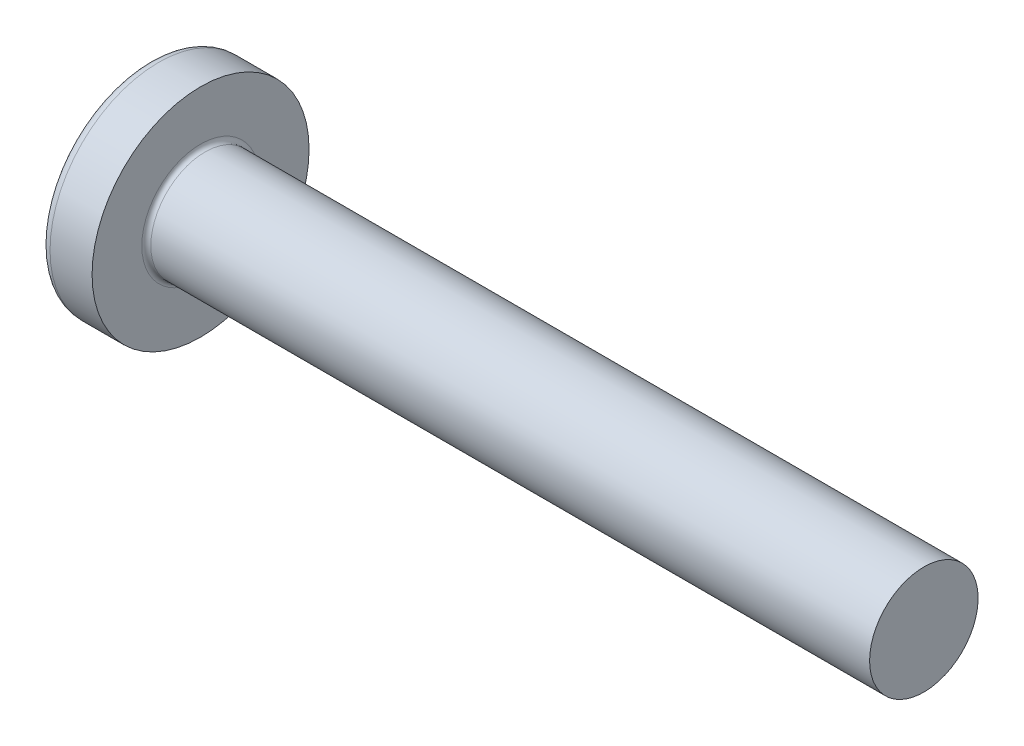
ISO-10303-21;
HEADER;
FILE_DESCRIPTION(('STEP AP214'),'2;1');
FILE_NAME('part.step','',(''),(''),'','','');
FILE_SCHEMA(('AUTOMOTIVE_DESIGN { 1 0 10303 214 1 1 1 1 }'));
ENDSEC;
DATA;
#1=APPLICATION_CONTEXT('core data for automotive mechanical design processes');
#2=APPLICATION_PROTOCOL_DEFINITION('international standard','automotive_design',2000,#1);
#3=PRODUCT_CONTEXT('',#1,'mechanical');
#4=PRODUCT('Part','Part','',(#3));
#5=PRODUCT_RELATED_PRODUCT_CATEGORY('part','',(#4));
#6=PRODUCT_DEFINITION_FORMATION('','',#4);
#7=PRODUCT_DEFINITION_CONTEXT('part definition',#1,'design');
#8=PRODUCT_DEFINITION('design','',#6,#7);
#9=PRODUCT_DEFINITION_SHAPE('','',#8);
#10=(LENGTH_UNIT() NAMED_UNIT(*) SI_UNIT(.MILLI.,.METRE.));
#11=(NAMED_UNIT(*) PLANE_ANGLE_UNIT() SI_UNIT($,.RADIAN.));
#12=(NAMED_UNIT(*) SI_UNIT($,.STERADIAN.) SOLID_ANGLE_UNIT());
#13=UNCERTAINTY_MEASURE_WITH_UNIT(LENGTH_MEASURE(1.E-05),#10,'distance_accuracy_value','');
#14=(GEOMETRIC_REPRESENTATION_CONTEXT(3) GLOBAL_UNCERTAINTY_ASSIGNED_CONTEXT((#13)) GLOBAL_UNIT_ASSIGNED_CONTEXT((#10,
#11,#12)) REPRESENTATION_CONTEXT('',''));
#15=CARTESIAN_POINT('',(0.,0.,0.));
#16=DIRECTION('',(0.,0.,1.));
#17=DIRECTION('',(1.,0.,0.));
#18=AXIS2_PLACEMENT_3D('',#15,#16,#17);
#19=CARTESIAN_POINT('',(10.,0.,0.));
#20=DIRECTION('',(-1.,0.,0.));
#21=DIRECTION('',(0.,1.,0.));
#22=AXIS2_PLACEMENT_3D('',#19,#20,#21);
#23=SPHERICAL_SURFACE('',#22,10.);
#24=CARTESIAN_POINT('',(1.83373872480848,0.,0.));
#25=DIRECTION('',(-1.,0.,0.));
#26=DIRECTION('',(0.,0.,1.));
#27=AXIS2_PLACEMENT_3D('',#24,#25,#26);
#28=CIRCLE('',#27,5.77167019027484);
#29=CARTESIAN_POINT('',(1.83373872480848,0.,5.77167019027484));
#30=VERTEX_POINT('',#29);
#31=EDGE_CURVE('E216',#30,#30,#28,.T.);
#32=ORIENTED_EDGE('',*,*,#31,.T.);
#33=EDGE_LOOP('',(#32));
#34=FACE_BOUND('',#33,.T.);
#35=CARTESIAN_POINT('',(0.11533271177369,0.,0.));
#36=DIRECTION('',(1.,0.,0.));
#37=DIRECTION('',(0.,0.,-1.));
#38=AXIS2_PLACEMENT_3D('',#35,#36,#37);
#39=CIRCLE('',#38,1.51438192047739);
#40=CARTESIAN_POINT('',(0.115332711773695,-0.709999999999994,-1.33762947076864));
#41=VERTEX_POINT('',#40);
#42=CARTESIAN_POINT('',(0.11533271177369,-1.33762947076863,-0.71));
#43=VERTEX_POINT('',#42);
#44=EDGE_CURVE('E343',#41,#43,#39,.F.);
#45=ORIENTED_EDGE('',*,*,#44,.F.);
#46=CARTESIAN_POINT('',(10.,-0.71,0.));
#47=DIRECTION('',(0.,1.,0.));
#48=DIRECTION('',(0.,0.,1.));
#49=AXIS2_PLACEMENT_3D('',#46,#47,#48);
#50=CIRCLE('',#49,9.97476315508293);
#51=CARTESIAN_POINT('',(0.516695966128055,-0.709999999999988,-3.09238493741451));
#52=VERTEX_POINT('',#51);
#53=EDGE_CURVE('E276',#52,#41,#50,.T.);
#54=ORIENTED_EDGE('',*,*,#53,.F.);
#55=CARTESIAN_POINT('',(9.3467899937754,0.,1.3101368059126));
#56=DIRECTION('',(0.446197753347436,0.,-0.894934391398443));
#57=DIRECTION('',(-0.894934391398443,0.,-0.446197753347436));
#58=AXIS2_PLACEMENT_3D('',#55,#56,#57);
#59=CIRCLE('',#58,9.89226254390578);
#60=CARTESIAN_POINT('',(0.516695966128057,0.710000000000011,-3.0923849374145));
#61=VERTEX_POINT('',#60);
#62=EDGE_CURVE('E250',#52,#61,#59,.T.);
#63=ORIENTED_EDGE('',*,*,#62,.T.);
#64=CARTESIAN_POINT('',(10.,0.71,0.));
#65=DIRECTION('',(0.,-1.,0.));
#66=DIRECTION('',(0.,0.,-1.));
#67=AXIS2_PLACEMENT_3D('',#64,#65,#66);
#68=CIRCLE('',#67,9.97476315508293);
#69=CARTESIAN_POINT('',(0.115332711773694,0.710000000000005,-1.33762947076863));
#70=VERTEX_POINT('',#69);
#71=EDGE_CURVE('E305',#70,#61,#68,.T.);
#72=ORIENTED_EDGE('',*,*,#71,.F.);
#73=CARTESIAN_POINT('',(0.11533271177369,1.33762947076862,-0.71));
#74=VERTEX_POINT('',#73);
#75=EDGE_CURVE('E358',#74,#70,#39,.F.);
#76=ORIENTED_EDGE('',*,*,#75,.F.);
#77=CARTESIAN_POINT('',(10.,0.,-0.71));
#78=DIRECTION('',(0.,0.,1.));
#79=DIRECTION('',(1.,0.,0.));
#80=AXIS2_PLACEMENT_3D('',#77,#78,#79);
#81=CIRCLE('',#80,9.97476315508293);
#82=CARTESIAN_POINT('',(0.516695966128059,3.0923849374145,-0.71));
#83=VERTEX_POINT('',#82);
#84=EDGE_CURVE('E244',#83,#74,#81,.T.);
#85=ORIENTED_EDGE('',*,*,#84,.F.);
#86=CARTESIAN_POINT('',(9.3467899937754,-1.3101368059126,0.));
#87=DIRECTION('',(0.446197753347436,0.894934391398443,0.));
#88=DIRECTION('',(-0.894934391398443,0.446197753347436,0.));
#89=AXIS2_PLACEMENT_3D('',#86,#87,#88);
#90=CIRCLE('',#89,9.89226254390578);
#91=CARTESIAN_POINT('',(0.516695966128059,3.09238493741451,0.71));
#92=VERTEX_POINT('',#91);
#93=EDGE_CURVE('E247',#83,#92,#90,.T.);
#94=ORIENTED_EDGE('',*,*,#93,.T.);
#95=CARTESIAN_POINT('',(10.,0.,0.71));
#96=DIRECTION('',(0.,0.,-1.));
#97=DIRECTION('',(-1.,0.,0.));
#98=AXIS2_PLACEMENT_3D('',#95,#96,#97);
#99=CIRCLE('',#98,9.97476315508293);
#100=CARTESIAN_POINT('',(0.11533271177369,1.33762947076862,0.709999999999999));
#101=VERTEX_POINT('',#100);
#102=EDGE_CURVE('E240',#101,#92,#99,.T.);
#103=ORIENTED_EDGE('',*,*,#102,.F.);
#104=CARTESIAN_POINT('',(0.115332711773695,0.709999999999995,1.33762947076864));
#105=VERTEX_POINT('',#104);
#106=EDGE_CURVE('E357',#105,#101,#39,.F.);
#107=ORIENTED_EDGE('',*,*,#106,.F.);
#108=CARTESIAN_POINT('',(0.516695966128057,0.709999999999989,3.09238493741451));
#109=VERTEX_POINT('',#108);
#110=EDGE_CURVE('E260',#109,#105,#68,.T.);
#111=ORIENTED_EDGE('',*,*,#110,.F.);
#112=CARTESIAN_POINT('',(9.3467899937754,0.,-1.3101368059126));
#113=DIRECTION('',(0.446197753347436,0.,0.894934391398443));
#114=DIRECTION('',(0.894934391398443,0.,-0.446197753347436));
#115=AXIS2_PLACEMENT_3D('',#112,#113,#114);
#116=CIRCLE('',#115,9.89226254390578);
#117=CARTESIAN_POINT('',(0.516695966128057,-0.710000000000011,3.0923849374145));
#118=VERTEX_POINT('',#117);
#119=EDGE_CURVE('E51',#109,#118,#116,.T.);
#120=ORIENTED_EDGE('',*,*,#119,.T.);
#121=CARTESIAN_POINT('',(0.115332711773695,-0.710000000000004,1.33762947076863));
#122=VERTEX_POINT('',#121);
#123=EDGE_CURVE('E257',#122,#118,#50,.T.);
#124=ORIENTED_EDGE('',*,*,#123,.F.);
#125=CARTESIAN_POINT('',(0.11533271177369,-1.33762947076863,0.709999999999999));
#126=VERTEX_POINT('',#125);
#127=EDGE_CURVE('E393',#126,#122,#39,.F.);
#128=ORIENTED_EDGE('',*,*,#127,.F.);
#129=CARTESIAN_POINT('',(0.516695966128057,-3.09238493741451,0.709999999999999));
#130=VERTEX_POINT('',#129);
#131=EDGE_CURVE('E241',#130,#126,#99,.T.);
#132=ORIENTED_EDGE('',*,*,#131,.F.);
#133=CARTESIAN_POINT('',(9.3467899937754,1.3101368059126,0.));
#134=DIRECTION('',(0.446197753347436,-0.894934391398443,0.));
#135=DIRECTION('',(0.894934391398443,0.446197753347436,0.));
#136=AXIS2_PLACEMENT_3D('',#133,#134,#135);
#137=CIRCLE('',#136,9.89226254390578);
#138=CARTESIAN_POINT('',(0.516695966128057,-3.0923849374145,-0.71));
#139=VERTEX_POINT('',#138);
#140=EDGE_CURVE('E237',#130,#139,#137,.T.);
#141=ORIENTED_EDGE('',*,*,#140,.T.);
#142=EDGE_CURVE('E66',#43,#139,#81,.T.);
#143=ORIENTED_EDGE('',*,*,#142,.F.);
#144=EDGE_LOOP('',(#45,#54,#63,#72,#76,#85,#94,#103,#107,#111,#120,#124,#128,#132,#141,#143));
#145=FACE_BOUND('',#144,.T.);
#146=ADVANCED_FACE('F37',(#34,#145),#23,.T.);
#147=CARTESIAN_POINT('',(3.46,1.62490792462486,-0.71));
#148=DIRECTION('',(0.,0.,1.));
#149=DIRECTION('',(1.,0.,0.));
#150=AXIS2_PLACEMENT_3D('',#147,#148,#149);
#151=PLANE('',#150);
#152=ORIENTED_EDGE('',*,*,#84,.T.);
#153=CARTESIAN_POINT('',(-2.28089704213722,1.52473965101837,-0.71));
#154=CARTESIAN_POINT('',(-1.81861622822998,1.48907386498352,-0.71));
#155=CARTESIAN_POINT('',(-1.35635131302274,1.45320000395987,-0.71));
#156=CARTESIAN_POINT('',(-0.431857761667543,1.3808964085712,-0.71));
#157=CARTESIAN_POINT('',(0.0303708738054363,1.34446666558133,-0.71));
#158=CARTESIAN_POINT('',(0.954772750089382,1.27091270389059,-0.71));
#159=CARTESIAN_POINT('',(1.41694599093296,1.23378848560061,-0.71));
#160=CARTESIAN_POINT('',(2.1101468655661,1.17741958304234,-0.71));
#161=CARTESIAN_POINT('',(2.34120225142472,1.15851633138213,-0.71));
#162=CARTESIAN_POINT('',(2.80329254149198,1.12044387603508,-0.71));
#163=CARTESIAN_POINT('',(3.03432744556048,1.10127467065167,-0.71));
#164=CARTESIAN_POINT('',(3.81376951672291,1.03608826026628,-0.71));
#165=CARTESIAN_POINT('',(4.3621185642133,0.989367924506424,-0.71));
#166=CARTESIAN_POINT('',(5.18446393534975,0.917336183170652,-0.71));
#167=CARTESIAN_POINT('',(5.45854573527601,0.893000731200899,-0.71));
#168=CARTESIAN_POINT('',(6.00663594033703,0.843493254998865,-0.71));
#169=CARTESIAN_POINT('',(6.28064434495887,0.818321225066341,-0.71));
#170=CARTESIAN_POINT('',(6.82859287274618,0.766879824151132,-0.71));
#171=CARTESIAN_POINT('',(7.10253298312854,0.740610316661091,-0.71));
#172=CARTESIAN_POINT('',(7.65026285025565,0.686585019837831,-0.71));
#173=CARTESIAN_POINT('',(7.92405260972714,0.658829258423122,-0.71));
#174=CARTESIAN_POINT('',(8.33458184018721,0.615573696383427,-0.71));
#175=CARTESIAN_POINT('',(8.4714065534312,0.600884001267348,-0.71));
#176=CARTESIAN_POINT('',(8.74498055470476,0.570826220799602,-0.71));
#177=CARTESIAN_POINT('',(8.88172984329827,0.555458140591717,-0.71));
#178=CARTESIAN_POINT('',(9.15513948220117,0.523868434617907,-0.71));
#179=CARTESIAN_POINT('',(9.29179982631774,0.507646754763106,-0.71));
#180=CARTESIAN_POINT('',(9.56498051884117,0.474039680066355,-0.71));
#181=CARTESIAN_POINT('',(9.70150086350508,0.45665425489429,-0.71));
#182=CARTESIAN_POINT('',(9.83792645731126,0.438531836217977,-0.71));
#183=B_SPLINE_CURVE_WITH_KNOTS('',3,(#153,#154,#155,#156,#157,#158,#159,#160,#161,#162,#163,
#164,#165,#166,#167,#168,#169,#170,#171,#172,#173,#174,#175,#176,#177,#178,#179,#180,#181,#182),
.UNSPECIFIED.,.F.,.F.,(4,2,2,2,2,2,2,2,2,2,2,2,2,2,4),(0.,1.39096401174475,2.78194962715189,
4.17293441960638,4.86841633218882,5.56390268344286,7.21490482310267,8.04038405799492,
8.86586891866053,9.69145676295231,10.5170291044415,10.9298607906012,11.3426893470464,
11.7555440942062,12.1684096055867),.UNSPECIFIED.);
#184=CARTESIAN_POINT('',(3.46,1.06563607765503,-0.710000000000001));
#185=VERTEX_POINT('',#184);
#186=EDGE_CURVE('E380',#74,#185,#183,.T.);
#187=ORIENTED_EDGE('',*,*,#186,.T.);
#188=DIRECTION('',(0.,1.,0.));
#189=VECTOR('',#188,1.);
#190=CARTESIAN_POINT('',(3.46,-1.62490792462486,-0.71));
#191=LINE('',#190,#189);
#192=CARTESIAN_POINT('',(3.46,1.62490792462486,-0.71));
#193=VERTEX_POINT('',#192);
#194=EDGE_CURVE('E326',#185,#193,#191,.T.);
#195=ORIENTED_EDGE('',*,*,#194,.T.);
#196=DIRECTION('',(0.894934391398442,-0.446197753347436,0.));
#197=VECTOR('',#196,1.);
#198=CARTESIAN_POINT('',(0.,3.35,-0.71));
#199=LINE('',#198,#197);
#200=EDGE_CURVE('E217',#83,#193,#199,.T.);
#201=ORIENTED_EDGE('',*,*,#200,.F.);
#202=EDGE_LOOP('',(#152,#187,#195,#201));
#203=FACE_BOUND('',#202,.T.);
#204=ADVANCED_FACE('F172',(#203),#151,.T.);
#205=CARTESIAN_POINT('',(3.46,-1.62490792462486,-0.71));
#206=VERTEX_POINT('',#205);
#207=CARTESIAN_POINT('',(3.46,-1.06563607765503,-0.710000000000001));
#208=VERTEX_POINT('',#207);
#209=EDGE_CURVE('E225',#206,#208,#191,.T.);
#210=ORIENTED_EDGE('',*,*,#209,.T.);
#211=CARTESIAN_POINT('',(-2.28089704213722,-1.52473965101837,-0.71));
#212=CARTESIAN_POINT('',(-1.81861622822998,-1.48907386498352,-0.71));
#213=CARTESIAN_POINT('',(-1.35635131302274,-1.45320000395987,-0.71));
#214=CARTESIAN_POINT('',(-0.431857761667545,-1.3808964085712,-0.71));
#215=CARTESIAN_POINT('',(0.0303708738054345,-1.34446666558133,-0.71));
#216=CARTESIAN_POINT('',(0.954772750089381,-1.27091270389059,-0.71));
#217=CARTESIAN_POINT('',(1.41694599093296,-1.23378848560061,-0.71));
#218=CARTESIAN_POINT('',(2.1101468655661,-1.17741958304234,-0.71));
#219=CARTESIAN_POINT('',(2.34120225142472,-1.15851633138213,-0.71));
#220=CARTESIAN_POINT('',(2.80329254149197,-1.12044387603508,-0.71));
#221=CARTESIAN_POINT('',(3.03432744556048,-1.10127467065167,-0.71));
#222=CARTESIAN_POINT('',(3.81376951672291,-1.03608826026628,-0.71));
#223=CARTESIAN_POINT('',(4.3621185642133,-0.989367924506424,-0.71));
#224=CARTESIAN_POINT('',(5.18446393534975,-0.917336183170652,-0.71));
#225=CARTESIAN_POINT('',(5.45854573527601,-0.893000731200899,-0.71));
#226=CARTESIAN_POINT('',(6.00663594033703,-0.843493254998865,-0.71));
#227=CARTESIAN_POINT('',(6.28064434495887,-0.818321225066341,-0.71));
#228=CARTESIAN_POINT('',(6.82859287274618,-0.766879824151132,-0.71));
#229=CARTESIAN_POINT('',(7.10253298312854,-0.740610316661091,-0.71));
#230=CARTESIAN_POINT('',(7.65026285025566,-0.686585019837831,-0.71));
#231=CARTESIAN_POINT('',(7.92405260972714,-0.658829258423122,-0.71));
#232=CARTESIAN_POINT('',(8.33458184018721,-0.615573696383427,-0.71));
#233=CARTESIAN_POINT('',(8.4714065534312,-0.600884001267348,-0.71));
#234=CARTESIAN_POINT('',(8.74498055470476,-0.570826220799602,-0.71));
#235=CARTESIAN_POINT('',(8.88172984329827,-0.555458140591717,-0.71));
#236=CARTESIAN_POINT('',(9.15513948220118,-0.523868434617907,-0.71));
#237=CARTESIAN_POINT('',(9.29179982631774,-0.507646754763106,-0.71));
#238=CARTESIAN_POINT('',(9.56498051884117,-0.474039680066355,-0.71));
#239=CARTESIAN_POINT('',(9.70150086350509,-0.456654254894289,-0.71));
#240=CARTESIAN_POINT('',(9.83792645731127,-0.438531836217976,-0.71));
#241=B_SPLINE_CURVE_WITH_KNOTS('',3,(#211,#212,#213,#214,#215,#216,#217,#218,#219,#220,#221,
#222,#223,#224,#225,#226,#227,#228,#229,#230,#231,#232,#233,#234,#235,#236,#237,#238,#239,#240),
.UNSPECIFIED.,.F.,.F.,(4,2,2,2,2,2,2,2,2,2,2,2,2,2,4),(0.,1.39096401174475,2.78194962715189,
4.17293441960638,4.86841633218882,5.56390268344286,7.21490482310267,8.04038405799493,
8.86586891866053,9.69145676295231,10.5170291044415,10.9298607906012,11.3426893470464,
11.7555440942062,12.1684096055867),.UNSPECIFIED.);
#242=EDGE_CURVE('E356',#208,#43,#241,.F.);
#243=ORIENTED_EDGE('',*,*,#242,.T.);
#244=ORIENTED_EDGE('',*,*,#142,.T.);
#245=DIRECTION('',(0.894934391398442,0.446197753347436,0.));
#246=VECTOR('',#245,1.);
#247=CARTESIAN_POINT('',(0.,-3.35,-0.71));
#248=LINE('',#247,#246);
#249=EDGE_CURVE('E308',#139,#206,#248,.T.);
#250=ORIENTED_EDGE('',*,*,#249,.T.);
#251=EDGE_LOOP('',(#210,#243,#244,#250));
#252=FACE_BOUND('',#251,.T.);
#253=ADVANCED_FACE('F178',(#252),#151,.T.);
#254=CARTESIAN_POINT('',(3.46,-1.62490792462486,0.71));
#255=DIRECTION('',(0.,0.,-1.));
#256=DIRECTION('',(-1.,0.,0.));
#257=AXIS2_PLACEMENT_3D('',#254,#255,#256);
#258=PLANE('',#257);
#259=DIRECTION('',(0.,-1.,0.));
#260=VECTOR('',#259,1.);
#261=CARTESIAN_POINT('',(3.46,1.62490792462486,0.71));
#262=LINE('',#261,#260);
#263=CARTESIAN_POINT('',(3.46,1.62490792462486,0.71));
#264=VERTEX_POINT('',#263);
#265=CARTESIAN_POINT('',(3.46,1.06563607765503,0.71));
#266=VERTEX_POINT('',#265);
#267=EDGE_CURVE('E316',#264,#266,#262,.T.);
#268=ORIENTED_EDGE('',*,*,#267,.T.);
#269=CARTESIAN_POINT('',(-2.28089705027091,1.52473965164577,0.709999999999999));
#270=CARTESIAN_POINT('',(-1.81861623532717,1.48907386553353,0.709999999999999));
#271=CARTESIAN_POINT('',(-1.35635131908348,1.45320000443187,0.709999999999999));
#272=CARTESIAN_POINT('',(-0.431857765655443,1.38089640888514,0.709999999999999));
#273=CARTESIAN_POINT('',(0.030370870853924,1.3444666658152,0.709999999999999));
#274=CARTESIAN_POINT('',(0.954772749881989,1.27091270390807,0.709999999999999));
#275=CARTESIAN_POINT('',(1.41694599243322,1.23378848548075,0.709999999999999));
#276=CARTESIAN_POINT('',(2.11014686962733,1.17741958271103,0.709999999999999));
#277=CARTESIAN_POINT('',(2.3412022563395,1.15851633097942,0.71));
#278=CARTESIAN_POINT('',(2.80329254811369,1.12044387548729,0.71));
#279=CARTESIAN_POINT('',(3.03432745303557,1.10127467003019,0.71));
#280=CARTESIAN_POINT('',(3.8137695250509,1.03608825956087,0.71));
#281=CARTESIAN_POINT('',(4.36211857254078,0.989367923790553,0.71));
#282=CARTESIAN_POINT('',(5.18446394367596,0.917336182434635,0.71));
#283=CARTESIAN_POINT('',(5.45854574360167,0.893000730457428,0.71));
#284=CARTESIAN_POINT('',(6.00663594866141,0.843493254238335,0.71));
#285=CARTESIAN_POINT('',(6.28064435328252,0.818321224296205,0.71));
#286=CARTESIAN_POINT('',(6.82859288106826,0.766879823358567,0.71));
#287=CARTESIAN_POINT('',(7.1025329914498,0.7406103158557,0.71));
#288=CARTESIAN_POINT('',(7.65026285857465,0.686585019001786,0.71));
#289=CARTESIAN_POINT('',(7.92405261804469,0.658829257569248,0.71));
#290=CARTESIAN_POINT('',(8.3345818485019,0.61557369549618,0.71));
#291=CARTESIAN_POINT('',(8.47140656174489,0.600884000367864,0.71));
#292=CARTESIAN_POINT('',(8.74498056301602,0.570826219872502,0.71));
#293=CARTESIAN_POINT('',(8.8817298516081,0.555458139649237,0.71));
#294=CARTESIAN_POINT('',(9.15513949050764,0.523868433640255,0.71));
#295=CARTESIAN_POINT('',(9.29179983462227,0.50764675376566,0.710000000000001));
#296=CARTESIAN_POINT('',(9.56498052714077,0.474039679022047,0.710000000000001));
#297=CARTESIAN_POINT('',(9.70150087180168,0.456654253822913,0.710000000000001));
#298=CARTESIAN_POINT('',(9.83792646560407,0.438531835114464,0.710000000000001));
#299=B_SPLINE_CURVE_WITH_KNOTS('',3,(#269,#270,#271,#272,#273,#274,#275,#276,#277,#278,#279,
#280,#281,#282,#283,#284,#285,#286,#287,#288,#289,#290,#291,#292,#293,#294,#295,#296,#297,#298),
.UNSPECIFIED.,.F.,.F.,(4,2,2,2,2,2,2,2,2,2,2,2,2,2,4),(0.,1.39096401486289,2.78194963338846,
4.17293443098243,4.86841634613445,5.56390269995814,7.21490483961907,8.04038407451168,
8.8658689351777,9.69145677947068,10.5170291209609,10.9298608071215,11.3426893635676,
11.7555441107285,12.1684096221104),.UNSPECIFIED.);
#300=EDGE_CURVE('E281',#266,#101,#299,.F.);
#301=ORIENTED_EDGE('',*,*,#300,.T.);
#302=ORIENTED_EDGE('',*,*,#102,.T.);
#303=DIRECTION('',(0.894934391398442,-0.446197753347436,0.));
#304=VECTOR('',#303,1.);
#305=CARTESIAN_POINT('',(0.,3.35,0.71));
#306=LINE('',#305,#304);
#307=EDGE_CURVE('E222',#92,#264,#306,.T.);
#308=ORIENTED_EDGE('',*,*,#307,.T.);
#309=EDGE_LOOP('',(#268,#301,#302,#308));
#310=FACE_BOUND('',#309,.T.);
#311=ADVANCED_FACE('F376',(#310),#258,.T.);
#312=ORIENTED_EDGE('',*,*,#131,.T.);
#313=CARTESIAN_POINT('',(-2.28089705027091,-1.52473965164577,0.709999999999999));
#314=CARTESIAN_POINT('',(-1.81861623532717,-1.48907386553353,0.709999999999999));
#315=CARTESIAN_POINT('',(-1.35635131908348,-1.45320000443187,0.709999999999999));
#316=CARTESIAN_POINT('',(-0.431857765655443,-1.38089640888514,0.709999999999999));
#317=CARTESIAN_POINT('',(0.0303708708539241,-1.3444666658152,0.709999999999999));
#318=CARTESIAN_POINT('',(0.954772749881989,-1.27091270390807,0.709999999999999));
#319=CARTESIAN_POINT('',(1.41694599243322,-1.23378848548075,0.709999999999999));
#320=CARTESIAN_POINT('',(2.11014686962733,-1.17741958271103,0.709999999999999));
#321=CARTESIAN_POINT('',(2.3412022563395,-1.15851633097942,0.709999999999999));
#322=CARTESIAN_POINT('',(2.80329254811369,-1.12044387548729,0.709999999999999));
#323=CARTESIAN_POINT('',(3.03432745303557,-1.10127467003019,0.71));
#324=CARTESIAN_POINT('',(3.81376952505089,-1.03608825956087,0.71));
#325=CARTESIAN_POINT('',(4.36211857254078,-0.989367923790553,0.71));
#326=CARTESIAN_POINT('',(5.18446394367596,-0.917336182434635,0.71));
#327=CARTESIAN_POINT('',(5.45854574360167,-0.893000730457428,0.71));
#328=CARTESIAN_POINT('',(6.00663594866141,-0.843493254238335,0.71));
#329=CARTESIAN_POINT('',(6.28064435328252,-0.818321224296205,0.71));
#330=CARTESIAN_POINT('',(6.82859288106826,-0.766879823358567,0.71));
#331=CARTESIAN_POINT('',(7.1025329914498,-0.7406103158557,0.71));
#332=CARTESIAN_POINT('',(7.65026285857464,-0.686585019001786,0.71));
#333=CARTESIAN_POINT('',(7.92405261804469,-0.658829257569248,0.71));
#334=CARTESIAN_POINT('',(8.3345818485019,-0.615573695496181,0.71));
#335=CARTESIAN_POINT('',(8.47140656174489,-0.600884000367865,0.71));
#336=CARTESIAN_POINT('',(8.74498056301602,-0.570826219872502,0.71));
#337=CARTESIAN_POINT('',(8.8817298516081,-0.555458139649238,0.71));
#338=CARTESIAN_POINT('',(9.15513949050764,-0.523868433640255,0.71));
#339=CARTESIAN_POINT('',(9.29179983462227,-0.50764675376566,0.71));
#340=CARTESIAN_POINT('',(9.56498052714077,-0.474039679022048,0.71));
#341=CARTESIAN_POINT('',(9.70150087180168,-0.456654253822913,0.71));
#342=CARTESIAN_POINT('',(9.83792646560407,-0.438531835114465,0.710000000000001));
#343=B_SPLINE_CURVE_WITH_KNOTS('',3,(#313,#314,#315,#316,#317,#318,#319,#320,#321,#322,#323,
#324,#325,#326,#327,#328,#329,#330,#331,#332,#333,#334,#335,#336,#337,#338,#339,#340,#341,#342),
.UNSPECIFIED.,.F.,.F.,(4,2,2,2,2,2,2,2,2,2,2,2,2,2,4),(0.,1.39096401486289,2.78194963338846,
4.17293443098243,4.86841634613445,5.56390269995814,7.21490483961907,8.04038407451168,
8.8658689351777,9.69145677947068,10.5170291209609,10.9298608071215,11.3426893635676,
11.7555441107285,12.1684096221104),.UNSPECIFIED.);
#344=CARTESIAN_POINT('',(3.46,-1.06563607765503,0.71));
#345=VERTEX_POINT('',#344);
#346=EDGE_CURVE('E394',#126,#345,#343,.T.);
#347=ORIENTED_EDGE('',*,*,#346,.T.);
#348=CARTESIAN_POINT('',(3.46,-1.62490792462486,0.71));
#349=VERTEX_POINT('',#348);
#350=EDGE_CURVE('E318',#345,#349,#262,.T.);
#351=ORIENTED_EDGE('',*,*,#350,.T.);
#352=DIRECTION('',(0.894934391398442,0.446197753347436,0.));
#353=VECTOR('',#352,1.);
#354=CARTESIAN_POINT('',(0.,-3.35,0.709999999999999));
#355=LINE('',#354,#353);
#356=EDGE_CURVE('E310',#130,#349,#355,.T.);
#357=ORIENTED_EDGE('',*,*,#356,.F.);
#358=EDGE_LOOP('',(#312,#347,#351,#357));
#359=FACE_BOUND('',#358,.T.);
#360=ADVANCED_FACE('F424',(#359),#258,.T.);
#361=CARTESIAN_POINT('',(3.46,1.62490792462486,-0.71));
#362=DIRECTION('',(-1.,0.,0.));
#363=DIRECTION('',(0.,0.,1.));
#364=AXIS2_PLACEMENT_3D('',#361,#362,#363);
#365=PLANE('',#364);
#366=ORIENTED_EDGE('',*,*,#350,.F.);
#367=CARTESIAN_POINT('',(3.46,0.,0.));
#368=DIRECTION('',(-1.,0.,0.));
#369=DIRECTION('',(0.,0.,1.));
#370=AXIS2_PLACEMENT_3D('',#367,#368,#369);
#371=CIRCLE('',#370,1.2805);
#372=EDGE_CURVE('E351',#208,#345,#371,.T.);
#373=ORIENTED_EDGE('',*,*,#372,.F.);
#374=ORIENTED_EDGE('',*,*,#209,.F.);
#375=DIRECTION('',(0.,0.,1.));
#376=VECTOR('',#375,1.);
#377=CARTESIAN_POINT('',(3.46,-1.62490792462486,-0.71));
#378=LINE('',#377,#376);
#379=EDGE_CURVE('E313',#206,#349,#378,.T.);
#380=ORIENTED_EDGE('',*,*,#379,.T.);
#381=EDGE_LOOP('',(#366,#373,#374,#380));
#382=FACE_BOUND('',#381,.T.);
#383=ADVANCED_FACE('F417',(#382),#365,.T.);
#384=DIRECTION('',(0.,0.,-1.));
#385=VECTOR('',#384,1.);
#386=CARTESIAN_POINT('',(3.46,-0.710000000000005,1.62490792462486));
#387=LINE('',#386,#385);
#388=CARTESIAN_POINT('',(3.46,-0.709999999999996,-1.06563607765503));
#389=VERTEX_POINT('',#388);
#390=CARTESIAN_POINT('',(3.46,-0.709999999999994,-1.62490792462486));
#391=VERTEX_POINT('',#390);
#392=EDGE_CURVE('E299',#389,#391,#387,.T.);
#393=ORIENTED_EDGE('',*,*,#392,.F.);
#394=CARTESIAN_POINT('',(3.46,0.710000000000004,-1.06563607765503));
#395=VERTEX_POINT('',#394);
#396=EDGE_CURVE('E58',#395,#389,#371,.T.);
#397=ORIENTED_EDGE('',*,*,#396,.F.);
#398=DIRECTION('',(0.,0.,1.));
#399=VECTOR('',#398,1.);
#400=CARTESIAN_POINT('',(3.46,0.710000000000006,-1.62490792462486));
#401=LINE('',#400,#399);
#402=CARTESIAN_POINT('',(3.46,0.710000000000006,-1.62490792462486));
#403=VERTEX_POINT('',#402);
#404=EDGE_CURVE('E302',#403,#395,#401,.T.);
#405=ORIENTED_EDGE('',*,*,#404,.F.);
#406=DIRECTION('',(0.,-1.,0.));
#407=VECTOR('',#406,1.);
#408=CARTESIAN_POINT('',(3.46,0.710000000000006,-1.62490792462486));
#409=LINE('',#408,#407);
#410=EDGE_CURVE('E293',#403,#391,#409,.T.);
#411=ORIENTED_EDGE('',*,*,#410,.T.);
#412=EDGE_LOOP('',(#393,#397,#405,#411));
#413=FACE_BOUND('',#412,.T.);
#414=ADVANCED_FACE('F346',(#413),#365,.T.);
#415=ORIENTED_EDGE('',*,*,#194,.F.);
#416=EDGE_CURVE('E350',#266,#185,#371,.T.);
#417=ORIENTED_EDGE('',*,*,#416,.F.);
#418=ORIENTED_EDGE('',*,*,#267,.F.);
#419=DIRECTION('',(0.,0.,-1.));
#420=VECTOR('',#419,1.);
#421=CARTESIAN_POINT('',(3.46,1.62490792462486,0.71));
#422=LINE('',#421,#420);
#423=EDGE_CURVE('E319',#264,#193,#422,.T.);
#424=ORIENTED_EDGE('',*,*,#423,.T.);
#425=EDGE_LOOP('',(#415,#417,#418,#424));
#426=FACE_BOUND('',#425,.T.);
#427=ADVANCED_FACE('F418',(#426),#365,.T.);
#428=CARTESIAN_POINT('',(3.46,0.709999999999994,1.62490792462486));
#429=DIRECTION('',(0.,-1.,0.));
#430=DIRECTION('',(1.,0.,0.));
#431=AXIS2_PLACEMENT_3D('',#428,#429,#430);
#432=PLANE('',#431);
#433=ORIENTED_EDGE('',*,*,#110,.T.);
#434=CARTESIAN_POINT('',(-2.28089704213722,0.709999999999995,1.52473965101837));
#435=CARTESIAN_POINT('',(-1.81861622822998,0.709999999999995,1.48907386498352));
#436=CARTESIAN_POINT('',(-1.35635131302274,0.709999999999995,1.45320000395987));
#437=CARTESIAN_POINT('',(-0.431857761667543,0.709999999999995,1.38089640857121));
#438=CARTESIAN_POINT('',(0.0303708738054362,0.709999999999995,1.34446666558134));
#439=CARTESIAN_POINT('',(0.954772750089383,0.709999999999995,1.2709127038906));
#440=CARTESIAN_POINT('',(1.41694599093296,0.709999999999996,1.23378848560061));
#441=CARTESIAN_POINT('',(2.1101468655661,0.709999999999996,1.17741958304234));
#442=CARTESIAN_POINT('',(2.34120225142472,0.709999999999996,1.15851633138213));
#443=CARTESIAN_POINT('',(2.80329254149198,0.709999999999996,1.12044387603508));
#444=CARTESIAN_POINT('',(3.03432744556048,0.709999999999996,1.10127467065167));
#445=CARTESIAN_POINT('',(3.81376951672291,0.709999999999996,1.03608826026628));
#446=CARTESIAN_POINT('',(4.3621185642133,0.709999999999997,0.989367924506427));
#447=CARTESIAN_POINT('',(5.18446393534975,0.709999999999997,0.917336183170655));
#448=CARTESIAN_POINT('',(5.45854573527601,0.709999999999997,0.893000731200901));
#449=CARTESIAN_POINT('',(6.00663594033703,0.709999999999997,0.843493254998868));
#450=CARTESIAN_POINT('',(6.28064434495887,0.709999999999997,0.818321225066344));
#451=CARTESIAN_POINT('',(6.82859287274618,0.709999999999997,0.766879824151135));
#452=CARTESIAN_POINT('',(7.10253298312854,0.709999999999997,0.740610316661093));
#453=CARTESIAN_POINT('',(7.65026285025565,0.709999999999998,0.686585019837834));
#454=CARTESIAN_POINT('',(7.92405260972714,0.709999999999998,0.658829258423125));
#455=CARTESIAN_POINT('',(8.33458184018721,0.709999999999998,0.615573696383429));
#456=CARTESIAN_POINT('',(8.4714065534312,0.709999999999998,0.60088400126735));
#457=CARTESIAN_POINT('',(8.74498055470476,0.709999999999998,0.570826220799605));
#458=CARTESIAN_POINT('',(8.88172984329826,0.709999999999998,0.55545814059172));
#459=CARTESIAN_POINT('',(9.15513948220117,0.709999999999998,0.52386843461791));
#460=CARTESIAN_POINT('',(9.29179982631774,0.709999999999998,0.507646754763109));
#461=CARTESIAN_POINT('',(9.56498051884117,0.709999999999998,0.474039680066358));
#462=CARTESIAN_POINT('',(9.70150086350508,0.709999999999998,0.456654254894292));
#463=CARTESIAN_POINT('',(9.83792645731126,0.709999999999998,0.438531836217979));
#464=B_SPLINE_CURVE_WITH_KNOTS('',3,(#434,#435,#436,#437,#438,#439,#440,#441,#442,#443,#444,
#445,#446,#447,#448,#449,#450,#451,#452,#453,#454,#455,#456,#457,#458,#459,#460,#461,#462,#463),
.UNSPECIFIED.,.F.,.F.,(4,2,2,2,2,2,2,2,2,2,2,2,2,2,4),(0.,1.39096401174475,2.78194962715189,
4.17293441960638,4.86841633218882,5.56390268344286,7.21490482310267,8.04038405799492,
8.86586891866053,9.69145676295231,10.5170291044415,10.9298607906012,11.3426893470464,
11.7555440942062,12.1684096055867),.UNSPECIFIED.);
#465=CARTESIAN_POINT('',(3.46,0.709999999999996,1.06563607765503));
#466=VERTEX_POINT('',#465);
#467=EDGE_CURVE('E442',#105,#466,#464,.T.);
#468=ORIENTED_EDGE('',*,*,#467,.T.);
#469=CARTESIAN_POINT('',(3.46,0.709999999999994,1.62490792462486));
#470=VERTEX_POINT('',#469);
#471=EDGE_CURVE('E274',#466,#470,#401,.T.);
#472=ORIENTED_EDGE('',*,*,#471,.T.);
#473=DIRECTION('',(0.894934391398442,0.,-0.446197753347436));
#474=VECTOR('',#473,1.);
#475=CARTESIAN_POINT('',(0.,0.709999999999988,3.35));
#476=LINE('',#475,#474);
#477=EDGE_CURVE('E267',#109,#470,#476,.T.);
#478=ORIENTED_EDGE('',*,*,#477,.F.);
#479=EDGE_LOOP('',(#433,#468,#472,#478));
#480=FACE_BOUND('',#479,.T.);
#481=ADVANCED_FACE('F271',(#480),#432,.T.);
#482=CARTESIAN_POINT('',(3.46,-0.709999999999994,-1.62490792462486));
#483=DIRECTION('',(0.,1.,0.));
#484=DIRECTION('',(-1.,0.,0.));
#485=AXIS2_PLACEMENT_3D('',#482,#483,#484);
#486=PLANE('',#485);
#487=CARTESIAN_POINT('',(3.46,-0.710000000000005,1.62490792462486));
#488=VERTEX_POINT('',#487);
#489=CARTESIAN_POINT('',(3.46,-0.710000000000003,1.06563607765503));
#490=VERTEX_POINT('',#489);
#491=EDGE_CURVE('E296',#488,#490,#387,.T.);
#492=ORIENTED_EDGE('',*,*,#491,.T.);
#493=CARTESIAN_POINT('',(-2.28089704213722,-0.710000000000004,1.52473965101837));
#494=CARTESIAN_POINT('',(-1.81861622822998,-0.710000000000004,1.48907386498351));
#495=CARTESIAN_POINT('',(-1.35635131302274,-0.710000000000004,1.45320000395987));
#496=CARTESIAN_POINT('',(-0.431857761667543,-0.710000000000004,1.3808964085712));
#497=CARTESIAN_POINT('',(0.0303708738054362,-0.710000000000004,1.34446666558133));
#498=CARTESIAN_POINT('',(0.954772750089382,-0.710000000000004,1.27091270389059));
#499=CARTESIAN_POINT('',(1.41694599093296,-0.710000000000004,1.23378848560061));
#500=CARTESIAN_POINT('',(2.1101468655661,-0.710000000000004,1.17741958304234));
#501=CARTESIAN_POINT('',(2.34120225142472,-0.710000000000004,1.15851633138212));
#502=CARTESIAN_POINT('',(2.80329254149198,-0.710000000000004,1.12044387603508));
#503=CARTESIAN_POINT('',(3.03432744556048,-0.710000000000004,1.10127467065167));
#504=CARTESIAN_POINT('',(3.81376951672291,-0.710000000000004,1.03608826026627));
#505=CARTESIAN_POINT('',(4.3621185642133,-0.710000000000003,0.989367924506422));
#506=CARTESIAN_POINT('',(5.18446393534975,-0.710000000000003,0.91733618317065));
#507=CARTESIAN_POINT('',(5.45854573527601,-0.710000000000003,0.893000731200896));
#508=CARTESIAN_POINT('',(6.00663594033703,-0.710000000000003,0.843493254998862));
#509=CARTESIAN_POINT('',(6.28064434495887,-0.710000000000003,0.818321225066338));
#510=CARTESIAN_POINT('',(6.82859287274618,-0.710000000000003,0.766879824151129));
#511=CARTESIAN_POINT('',(7.10253298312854,-0.710000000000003,0.740610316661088));
#512=CARTESIAN_POINT('',(7.65026285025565,-0.710000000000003,0.686585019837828));
#513=CARTESIAN_POINT('',(7.92405260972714,-0.710000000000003,0.658829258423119));
#514=CARTESIAN_POINT('',(8.33458184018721,-0.710000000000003,0.615573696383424));
#515=CARTESIAN_POINT('',(8.4714065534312,-0.710000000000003,0.600884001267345));
#516=CARTESIAN_POINT('',(8.74498055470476,-0.710000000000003,0.570826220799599));
#517=CARTESIAN_POINT('',(8.88172984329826,-0.710000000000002,0.555458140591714));
#518=CARTESIAN_POINT('',(9.15513948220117,-0.710000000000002,0.523868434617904));
#519=CARTESIAN_POINT('',(9.29179982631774,-0.710000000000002,0.507646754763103));
#520=CARTESIAN_POINT('',(9.56498051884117,-0.710000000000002,0.474039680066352));
#521=CARTESIAN_POINT('',(9.70150086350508,-0.710000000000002,0.456654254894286));
#522=CARTESIAN_POINT('',(9.83792645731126,-0.710000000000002,0.438531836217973));
#523=B_SPLINE_CURVE_WITH_KNOTS('',3,(#493,#494,#495,#496,#497,#498,#499,#500,#501,#502,#503,
#504,#505,#506,#507,#508,#509,#510,#511,#512,#513,#514,#515,#516,#517,#518,#519,#520,#521,#522),
.UNSPECIFIED.,.F.,.F.,(4,2,2,2,2,2,2,2,2,2,2,2,2,2,4),(0.,1.39096401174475,2.78194962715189,
4.17293441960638,4.86841633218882,5.56390268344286,7.21490482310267,8.04038405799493,
8.86586891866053,9.69145676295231,10.5170291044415,10.9298607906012,11.3426893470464,
11.7555440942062,12.1684096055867),.UNSPECIFIED.);
#524=EDGE_CURVE('E386',#490,#122,#523,.F.);
#525=ORIENTED_EDGE('',*,*,#524,.T.);
#526=ORIENTED_EDGE('',*,*,#123,.T.);
#527=DIRECTION('',(0.894934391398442,0.,-0.446197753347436));
#528=VECTOR('',#527,1.);
#529=CARTESIAN_POINT('',(0.,-0.710000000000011,3.35));
#530=LINE('',#529,#528);
#531=EDGE_CURVE('E269',#118,#488,#530,.T.);
#532=ORIENTED_EDGE('',*,*,#531,.T.);
#533=EDGE_LOOP('',(#492,#525,#526,#532));
#534=FACE_BOUND('',#533,.T.);
#535=ADVANCED_FACE('F207',(#534),#486,.T.);
#536=ORIENTED_EDGE('',*,*,#404,.T.);
#537=CARTESIAN_POINT('',(-2.28089704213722,0.710000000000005,-1.52473965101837));
#538=CARTESIAN_POINT('',(-1.81861622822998,0.710000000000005,-1.48907386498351));
#539=CARTESIAN_POINT('',(-1.35635131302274,0.710000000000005,-1.45320000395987));
#540=CARTESIAN_POINT('',(-0.431857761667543,0.710000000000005,-1.3808964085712));
#541=CARTESIAN_POINT('',(0.0303708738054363,0.710000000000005,-1.34446666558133));
#542=CARTESIAN_POINT('',(0.954772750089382,0.710000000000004,-1.27091270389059));
#543=CARTESIAN_POINT('',(1.41694599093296,0.710000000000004,-1.23378848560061));
#544=CARTESIAN_POINT('',(2.1101468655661,0.710000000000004,-1.17741958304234));
#545=CARTESIAN_POINT('',(2.34120225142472,0.710000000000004,-1.15851633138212));
#546=CARTESIAN_POINT('',(2.80329254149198,0.710000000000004,-1.12044387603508));
#547=CARTESIAN_POINT('',(3.03432744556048,0.710000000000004,-1.10127467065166));
#548=CARTESIAN_POINT('',(3.81376951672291,0.710000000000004,-1.03608826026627));
#549=CARTESIAN_POINT('',(4.3621185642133,0.710000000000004,-0.989367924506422));
#550=CARTESIAN_POINT('',(5.18446393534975,0.710000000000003,-0.91733618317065));
#551=CARTESIAN_POINT('',(5.45854573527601,0.710000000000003,-0.893000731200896));
#552=CARTESIAN_POINT('',(6.00663594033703,0.710000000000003,-0.843493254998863));
#553=CARTESIAN_POINT('',(6.28064434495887,0.710000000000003,-0.818321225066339));
#554=CARTESIAN_POINT('',(6.82859287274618,0.710000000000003,-0.76687982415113));
#555=CARTESIAN_POINT('',(7.10253298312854,0.710000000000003,-0.740610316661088));
#556=CARTESIAN_POINT('',(7.65026285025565,0.710000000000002,-0.686585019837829));
#557=CARTESIAN_POINT('',(7.92405260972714,0.710000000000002,-0.65882925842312));
#558=CARTESIAN_POINT('',(8.33458184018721,0.710000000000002,-0.615573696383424));
#559=CARTESIAN_POINT('',(8.4714065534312,0.710000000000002,-0.600884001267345));
#560=CARTESIAN_POINT('',(8.74498055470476,0.710000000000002,-0.5708262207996));
#561=CARTESIAN_POINT('',(8.88172984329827,0.710000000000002,-0.555458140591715));
#562=CARTESIAN_POINT('',(9.15513948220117,0.710000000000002,-0.523868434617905));
#563=CARTESIAN_POINT('',(9.29179982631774,0.710000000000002,-0.507646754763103));
#564=CARTESIAN_POINT('',(9.56498051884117,0.710000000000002,-0.474039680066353));
#565=CARTESIAN_POINT('',(9.70150086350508,0.710000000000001,-0.456654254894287));
#566=CARTESIAN_POINT('',(9.83792645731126,0.710000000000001,-0.438531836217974));
#567=B_SPLINE_CURVE_WITH_KNOTS('',3,(#537,#538,#539,#540,#541,#542,#543,#544,#545,#546,#547,
#548,#549,#550,#551,#552,#553,#554,#555,#556,#557,#558,#559,#560,#561,#562,#563,#564,#565,#566),
.UNSPECIFIED.,.F.,.F.,(4,2,2,2,2,2,2,2,2,2,2,2,2,2,4),(0.,1.39096401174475,2.78194962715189,
4.17293441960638,4.86841633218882,5.56390268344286,7.21490482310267,8.04038405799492,
8.86586891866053,9.69145676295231,10.5170291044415,10.9298607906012,11.3426893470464,
11.7555440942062,12.1684096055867),.UNSPECIFIED.);
#568=EDGE_CURVE('E335',#395,#70,#567,.F.);
#569=ORIENTED_EDGE('',*,*,#568,.T.);
#570=ORIENTED_EDGE('',*,*,#71,.T.);
#571=DIRECTION('',(0.894934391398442,0.,0.446197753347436));
#572=VECTOR('',#571,1.);
#573=CARTESIAN_POINT('',(0.,0.710000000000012,-3.35));
#574=LINE('',#573,#572);
#575=EDGE_CURVE('E278',#61,#403,#574,.T.);
#576=ORIENTED_EDGE('',*,*,#575,.T.);
#577=EDGE_LOOP('',(#536,#569,#570,#576));
#578=FACE_BOUND('',#577,.T.);
#579=ADVANCED_FACE('F205',(#578),#432,.T.);
#580=ORIENTED_EDGE('',*,*,#53,.T.);
#581=CARTESIAN_POINT('',(-2.28089704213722,-0.709999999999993,-1.52473965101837));
#582=CARTESIAN_POINT('',(-1.81861622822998,-0.709999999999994,-1.48907386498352));
#583=CARTESIAN_POINT('',(-1.35635131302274,-0.709999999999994,-1.45320000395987));
#584=CARTESIAN_POINT('',(-0.431857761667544,-0.709999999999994,-1.38089640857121));
#585=CARTESIAN_POINT('',(0.0303708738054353,-0.709999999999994,-1.34446666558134));
#586=CARTESIAN_POINT('',(0.954772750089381,-0.709999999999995,-1.2709127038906));
#587=CARTESIAN_POINT('',(1.41694599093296,-0.709999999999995,-1.23378848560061));
#588=CARTESIAN_POINT('',(2.1101468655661,-0.709999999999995,-1.17741958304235));
#589=CARTESIAN_POINT('',(2.34120225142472,-0.709999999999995,-1.15851633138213));
#590=CARTESIAN_POINT('',(2.80329254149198,-0.709999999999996,-1.12044387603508));
#591=CARTESIAN_POINT('',(3.03432744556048,-0.709999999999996,-1.10127467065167));
#592=CARTESIAN_POINT('',(3.81376951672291,-0.709999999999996,-1.03608826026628));
#593=CARTESIAN_POINT('',(4.3621185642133,-0.709999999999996,-0.989367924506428));
#594=CARTESIAN_POINT('',(5.18446393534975,-0.709999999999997,-0.917336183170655));
#595=CARTESIAN_POINT('',(5.45854573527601,-0.709999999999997,-0.893000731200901));
#596=CARTESIAN_POINT('',(6.00663594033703,-0.709999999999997,-0.843493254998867));
#597=CARTESIAN_POINT('',(6.28064434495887,-0.709999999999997,-0.818321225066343));
#598=CARTESIAN_POINT('',(6.82859287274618,-0.709999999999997,-0.766879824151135));
#599=CARTESIAN_POINT('',(7.10253298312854,-0.709999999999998,-0.740610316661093));
#600=CARTESIAN_POINT('',(7.65026285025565,-0.709999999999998,-0.686585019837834));
#601=CARTESIAN_POINT('',(7.92405260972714,-0.709999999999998,-0.658829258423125));
#602=CARTESIAN_POINT('',(8.33458184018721,-0.709999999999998,-0.615573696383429));
#603=CARTESIAN_POINT('',(8.4714065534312,-0.709999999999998,-0.60088400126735));
#604=CARTESIAN_POINT('',(8.74498055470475,-0.709999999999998,-0.570826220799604));
#605=CARTESIAN_POINT('',(8.88172984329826,-0.709999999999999,-0.555458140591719));
#606=CARTESIAN_POINT('',(9.15513948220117,-0.709999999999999,-0.523868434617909));
#607=CARTESIAN_POINT('',(9.29179982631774,-0.709999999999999,-0.507646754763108));
#608=CARTESIAN_POINT('',(9.56498051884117,-0.709999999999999,-0.474039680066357));
#609=CARTESIAN_POINT('',(9.70150086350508,-0.709999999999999,-0.456654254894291));
#610=CARTESIAN_POINT('',(9.83792645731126,-0.709999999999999,-0.438531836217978));
#611=B_SPLINE_CURVE_WITH_KNOTS('',3,(#581,#582,#583,#584,#585,#586,#587,#588,#589,#590,#591,
#592,#593,#594,#595,#596,#597,#598,#599,#600,#601,#602,#603,#604,#605,#606,#607,#608,#609,#610),
.UNSPECIFIED.,.F.,.F.,(4,2,2,2,2,2,2,2,2,2,2,2,2,2,4),(0.,1.39096401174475,2.78194962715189,
4.17293441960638,4.86841633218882,5.56390268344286,7.21490482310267,8.04038405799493,
8.86586891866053,9.69145676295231,10.5170291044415,10.9298607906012,11.3426893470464,
11.7555440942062,12.1684096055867),.UNSPECIFIED.);
#612=EDGE_CURVE('E11',#41,#389,#611,.T.);
#613=ORIENTED_EDGE('',*,*,#612,.T.);
#614=ORIENTED_EDGE('',*,*,#392,.T.);
#615=DIRECTION('',(0.894934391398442,0.,0.446197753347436));
#616=VECTOR('',#615,1.);
#617=CARTESIAN_POINT('',(0.,-0.709999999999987,-3.35));
#618=LINE('',#617,#616);
#619=EDGE_CURVE('E290',#52,#391,#618,.T.);
#620=ORIENTED_EDGE('',*,*,#619,.F.);
#621=EDGE_LOOP('',(#580,#613,#614,#620));
#622=FACE_BOUND('',#621,.T.);
#623=ADVANCED_FACE('F200',(#622),#486,.T.);
#624=CARTESIAN_POINT('',(-25.4,0.,0.));
#625=DIRECTION('',(-1.,0.,0.));
#626=DIRECTION('',(0.,0.,1.));
#627=AXIS2_PLACEMENT_3D('',#624,#625,#626);
#628=CYLINDRICAL_SURFACE('',#627,3.);
#629=CARTESIAN_POINT('',(4.85,0.,0.));
#630=DIRECTION('',(-1.,0.,0.));
#631=DIRECTION('',(0.,0.,1.));
#632=AXIS2_PLACEMENT_3D('',#629,#630,#631);
#633=CIRCLE('',#632,3.);
#634=CARTESIAN_POINT('',(4.85,0.,3.));
#635=VERTEX_POINT('',#634);
#636=EDGE_CURVE('E211',#635,#635,#633,.F.);
#637=ORIENTED_EDGE('',*,*,#636,.T.);
#638=EDGE_LOOP('',(#637));
#639=FACE_BOUND('',#638,.T.);
#640=CARTESIAN_POINT('',(44.6,0.,0.));
#641=DIRECTION('',(-1.,0.,0.));
#642=DIRECTION('',(0.,0.,1.));
#643=AXIS2_PLACEMENT_3D('',#640,#641,#642);
#644=CIRCLE('',#643,3.);
#645=CARTESIAN_POINT('',(44.6,0.,3.));
#646=VERTEX_POINT('',#645);
#647=EDGE_CURVE('E214',#646,#646,#644,.T.);
#648=ORIENTED_EDGE('',*,*,#647,.T.);
#649=EDGE_LOOP('',(#648));
#650=FACE_BOUND('',#649,.T.);
#651=ADVANCED_FACE('F197',(#639,#650),#628,.T.);
#652=CARTESIAN_POINT('',(4.6,3.,0.));
#653=DIRECTION('',(-1.,0.,0.));
#654=DIRECTION('',(0.,0.,1.));
#655=AXIS2_PLACEMENT_3D('',#652,#653,#654);
#656=PLANE('',#655);
#657=CARTESIAN_POINT('',(4.6,0.,0.));
#658=DIRECTION('',(-1.,0.,0.));
#659=DIRECTION('',(0.,0.,1.));
#660=AXIS2_PLACEMENT_3D('',#657,#658,#659);
#661=CIRCLE('',#660,3.25);
#662=CARTESIAN_POINT('',(4.6,0.,3.25));
#663=VERTEX_POINT('',#662);
#664=EDGE_CURVE('E233',#663,#663,#661,.T.);
#665=ORIENTED_EDGE('',*,*,#664,.T.);
#666=EDGE_LOOP('',(#665));
#667=FACE_BOUND('',#666,.T.);
#668=CARTESIAN_POINT('',(4.6,0.,0.));
#669=DIRECTION('',(-1.,0.,0.));
#670=DIRECTION('',(0.,0.,1.));
#671=AXIS2_PLACEMENT_3D('',#668,#669,#670);
#672=CIRCLE('',#671,6.);
#673=CARTESIAN_POINT('',(4.6,0.,6.));
#674=VERTEX_POINT('',#673);
#675=EDGE_CURVE('E230',#674,#674,#672,.T.);
#676=ORIENTED_EDGE('',*,*,#675,.F.);
#677=EDGE_LOOP('',(#676));
#678=FACE_BOUND('',#677,.T.);
#679=ADVANCED_FACE('F194',(#667,#678),#656,.F.);
#680=CARTESIAN_POINT('',(-25.4,0.,0.));
#681=DIRECTION('',(-1.,0.,0.));
#682=DIRECTION('',(0.,0.,1.));
#683=AXIS2_PLACEMENT_3D('',#680,#681,#682);
#684=CYLINDRICAL_SURFACE('',#683,6.);
#685=ORIENTED_EDGE('',*,*,#675,.T.);
#686=EDGE_LOOP('',(#685));
#687=FACE_BOUND('',#686,.T.);
#688=CARTESIAN_POINT('',(2.27471683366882,0.,0.));
#689=DIRECTION('',(-1.,0.,0.));
#690=DIRECTION('',(0.,0.,1.));
#691=AXIS2_PLACEMENT_3D('',#688,#689,#690);
#692=CIRCLE('',#691,6.);
#693=CARTESIAN_POINT('',(2.27471683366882,0.,6.));
#694=VERTEX_POINT('',#693);
#695=EDGE_CURVE('E219',#694,#694,#692,.T.);
#696=ORIENTED_EDGE('',*,*,#695,.F.);
#697=EDGE_LOOP('',(#696));
#698=FACE_BOUND('',#697,.T.);
#699=ADVANCED_FACE('F190',(#687,#698),#684,.T.);
#700=CARTESIAN_POINT('',(2.27471683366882,0.,0.));
#701=DIRECTION('',(-1.,0.,0.));
#702=DIRECTION('',(0.,0.,1.));
#703=AXIS2_PLACEMENT_3D('',#700,#701,#702);
#704=TOROIDAL_SURFACE('',#703,5.46,0.54);
#705=ORIENTED_EDGE('',*,*,#695,.T.);
#706=EDGE_LOOP('',(#705));
#707=FACE_BOUND('',#706,.T.);
#708=ORIENTED_EDGE('',*,*,#31,.F.);
#709=EDGE_LOOP('',(#708));
#710=FACE_BOUND('',#709,.T.);
#711=ADVANCED_FACE('F187',(#707,#710),#704,.T.);
#712=CARTESIAN_POINT('',(44.6,3.,0.));
#713=DIRECTION('',(1.,0.,0.));
#714=DIRECTION('',(0.,0.,-1.));
#715=AXIS2_PLACEMENT_3D('',#712,#713,#714);
#716=PLANE('',#715);
#717=ORIENTED_EDGE('',*,*,#647,.F.);
#718=EDGE_LOOP('',(#717));
#719=FACE_BOUND('',#718,.T.);
#720=ADVANCED_FACE('F185',(#719),#716,.T.);
#721=CARTESIAN_POINT('',(4.85,0.,0.));
#722=DIRECTION('',(-1.,0.,0.));
#723=DIRECTION('',(0.,0.,1.));
#724=AXIS2_PLACEMENT_3D('',#721,#722,#723);
#725=TOROIDAL_SURFACE('',#724,3.25,0.25);
#726=ORIENTED_EDGE('',*,*,#636,.F.);
#727=EDGE_LOOP('',(#726));
#728=FACE_BOUND('',#727,.T.);
#729=ORIENTED_EDGE('',*,*,#664,.F.);
#730=EDGE_LOOP('',(#729));
#731=FACE_BOUND('',#730,.T.);
#732=ADVANCED_FACE('F39',(#728,#731),#725,.F.);
#733=CARTESIAN_POINT('',(3.46,1.62490792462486,0.71));
#734=DIRECTION('',(0.446197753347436,0.894934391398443,0.));
#735=DIRECTION('',(-0.894934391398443,0.446197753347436,0.));
#736=AXIS2_PLACEMENT_3D('',#733,#734,#735);
#737=PLANE('',#736);
#738=ORIENTED_EDGE('',*,*,#200,.T.);
#739=ORIENTED_EDGE('',*,*,#423,.F.);
#740=ORIENTED_EDGE('',*,*,#307,.F.);
#741=ORIENTED_EDGE('',*,*,#93,.F.);
#742=EDGE_LOOP('',(#738,#739,#740,#741));
#743=FACE_BOUND('',#742,.T.);
#744=ADVANCED_FACE('F374',(#743),#737,.F.);
#745=CARTESIAN_POINT('',(3.46,-1.62490792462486,-0.71));
#746=DIRECTION('',(0.446197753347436,-0.894934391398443,0.));
#747=DIRECTION('',(0.894934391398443,0.446197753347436,0.));
#748=AXIS2_PLACEMENT_3D('',#745,#746,#747);
#749=PLANE('',#748);
#750=ORIENTED_EDGE('',*,*,#356,.T.);
#751=ORIENTED_EDGE('',*,*,#379,.F.);
#752=ORIENTED_EDGE('',*,*,#249,.F.);
#753=ORIENTED_EDGE('',*,*,#140,.F.);
#754=EDGE_LOOP('',(#750,#751,#752,#753));
#755=FACE_BOUND('',#754,.T.);
#756=ADVANCED_FACE('F415',(#755),#749,.F.);
#757=ORIENTED_EDGE('',*,*,#471,.F.);
#758=EDGE_CURVE('E354',#490,#466,#371,.T.);
#759=ORIENTED_EDGE('',*,*,#758,.F.);
#760=ORIENTED_EDGE('',*,*,#491,.F.);
#761=DIRECTION('',(0.,1.,0.));
#762=VECTOR('',#761,1.);
#763=CARTESIAN_POINT('',(3.46,-0.710000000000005,1.62490792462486));
#764=LINE('',#763,#762);
#765=EDGE_CURVE('E300',#488,#470,#764,.T.);
#766=ORIENTED_EDGE('',*,*,#765,.T.);
#767=EDGE_LOOP('',(#757,#759,#760,#766));
#768=FACE_BOUND('',#767,.T.);
#769=ADVANCED_FACE('F411',(#768),#365,.T.);
#770=CARTESIAN_POINT('',(3.46,-0.710000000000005,1.62490792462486));
#771=DIRECTION('',(0.446197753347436,0.,0.894934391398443));
#772=DIRECTION('',(-0.894934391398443,0.,0.446197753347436));
#773=AXIS2_PLACEMENT_3D('',#770,#771,#772);
#774=PLANE('',#773);
#775=ORIENTED_EDGE('',*,*,#477,.T.);
#776=ORIENTED_EDGE('',*,*,#765,.F.);
#777=ORIENTED_EDGE('',*,*,#531,.F.);
#778=ORIENTED_EDGE('',*,*,#119,.F.);
#779=EDGE_LOOP('',(#775,#776,#777,#778));
#780=FACE_BOUND('',#779,.T.);
#781=ADVANCED_FACE('F265',(#780),#774,.F.);
#782=CARTESIAN_POINT('',(3.46,0.710000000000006,-1.62490792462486));
#783=DIRECTION('',(0.446197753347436,0.,-0.894934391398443));
#784=DIRECTION('',(0.894934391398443,0.,0.446197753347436));
#785=AXIS2_PLACEMENT_3D('',#782,#783,#784);
#786=PLANE('',#785);
#787=ORIENTED_EDGE('',*,*,#619,.T.);
#788=ORIENTED_EDGE('',*,*,#410,.F.);
#789=ORIENTED_EDGE('',*,*,#575,.F.);
#790=ORIENTED_EDGE('',*,*,#62,.F.);
#791=EDGE_LOOP('',(#787,#788,#789,#790));
#792=FACE_BOUND('',#791,.T.);
#793=ADVANCED_FACE('F338',(#792),#786,.F.);
#794=CARTESIAN_POINT('',(3.46,0.,0.));
#795=DIRECTION('',(-1.,0.,0.));
#796=DIRECTION('',(0.,0.,1.));
#797=AXIS2_PLACEMENT_3D('',#794,#795,#796);
#798=CONICAL_SURFACE('',#797,1.2805,0.0698131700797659);
#799=EDGE_CURVE('E352',#466,#266,#371,.T.);
#800=ORIENTED_EDGE('',*,*,#799,.F.);
#801=ORIENTED_EDGE('',*,*,#467,.F.);
#802=ORIENTED_EDGE('',*,*,#106,.T.);
#803=ORIENTED_EDGE('',*,*,#300,.F.);
#804=EDGE_LOOP('',(#800,#801,#802,#803));
#805=FACE_BOUND('',#804,.T.);
#806=ADVANCED_FACE('F169',(#805),#798,.F.);
#807=ORIENTED_EDGE('',*,*,#127,.T.);
#808=ORIENTED_EDGE('',*,*,#524,.F.);
#809=EDGE_CURVE('E451',#345,#490,#371,.T.);
#810=ORIENTED_EDGE('',*,*,#809,.F.);
#811=ORIENTED_EDGE('',*,*,#346,.F.);
#812=EDGE_LOOP('',(#807,#808,#810,#811));
#813=FACE_BOUND('',#812,.T.);
#814=ADVANCED_FACE('F409',(#813),#798,.F.);
#815=ORIENTED_EDGE('',*,*,#75,.T.);
#816=ORIENTED_EDGE('',*,*,#568,.F.);
#817=EDGE_CURVE('E347',#185,#395,#371,.T.);
#818=ORIENTED_EDGE('',*,*,#817,.F.);
#819=ORIENTED_EDGE('',*,*,#186,.F.);
#820=EDGE_LOOP('',(#815,#816,#818,#819));
#821=FACE_BOUND('',#820,.T.);
#822=ADVANCED_FACE('F167',(#821),#798,.F.);
#823=EDGE_CURVE('E348',#389,#208,#371,.T.);
#824=ORIENTED_EDGE('',*,*,#823,.F.);
#825=ORIENTED_EDGE('',*,*,#612,.F.);
#826=ORIENTED_EDGE('',*,*,#44,.T.);
#827=ORIENTED_EDGE('',*,*,#242,.F.);
#828=EDGE_LOOP('',(#824,#825,#826,#827));
#829=FACE_BOUND('',#828,.T.);
#830=ADVANCED_FACE('F162',(#829),#798,.F.);
#831=CARTESIAN_POINT('',(3.87605967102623,0.,0.));
#832=DIRECTION('',(-1.,0.,0.));
#833=DIRECTION('',(0.,0.,1.));
#834=AXIS2_PLACEMENT_3D('',#831,#832,#833);
#835=CONICAL_SURFACE('',#834,0.,1.25663706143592);
#836=ORIENTED_EDGE('',*,*,#799,.T.);
#837=ORIENTED_EDGE('',*,*,#416,.T.);
#838=ORIENTED_EDGE('',*,*,#817,.T.);
#839=ORIENTED_EDGE('',*,*,#396,.T.);
#840=ORIENTED_EDGE('',*,*,#823,.T.);
#841=ORIENTED_EDGE('',*,*,#372,.T.);
#842=ORIENTED_EDGE('',*,*,#809,.T.);
#843=ORIENTED_EDGE('',*,*,#758,.T.);
#844=EDGE_LOOP('',(#836,#837,#838,#839,#840,#841,#842,#843));
#845=FACE_BOUND('',#844,.T.);
#846=CARTESIAN_POINT('',(3.87605967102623,0.,0.));
#847=VERTEX_POINT('',#846);
#848=VERTEX_LOOP('',#847);
#849=FACE_BOUND('',#848,.T.);
#850=ADVANCED_FACE('F160',(#845,#849),#835,.F.);
#851=CLOSED_SHELL('',(#146,#204,#253,#311,#360,#383,#414,#427,#481,#535,#579,#623,#651,#679,
#699,#711,#720,#732,#744,#756,#769,#781,#793,#806,#814,#822,#830,#850));
#852=MANIFOLD_SOLID_BREP('B2',#851);
#853=ADVANCED_BREP_SHAPE_REPRESENTATION('',(#18,#852),#14);
#854=SHAPE_DEFINITION_REPRESENTATION(#9,#853);
ENDSEC;
END-ISO-10303-21;
